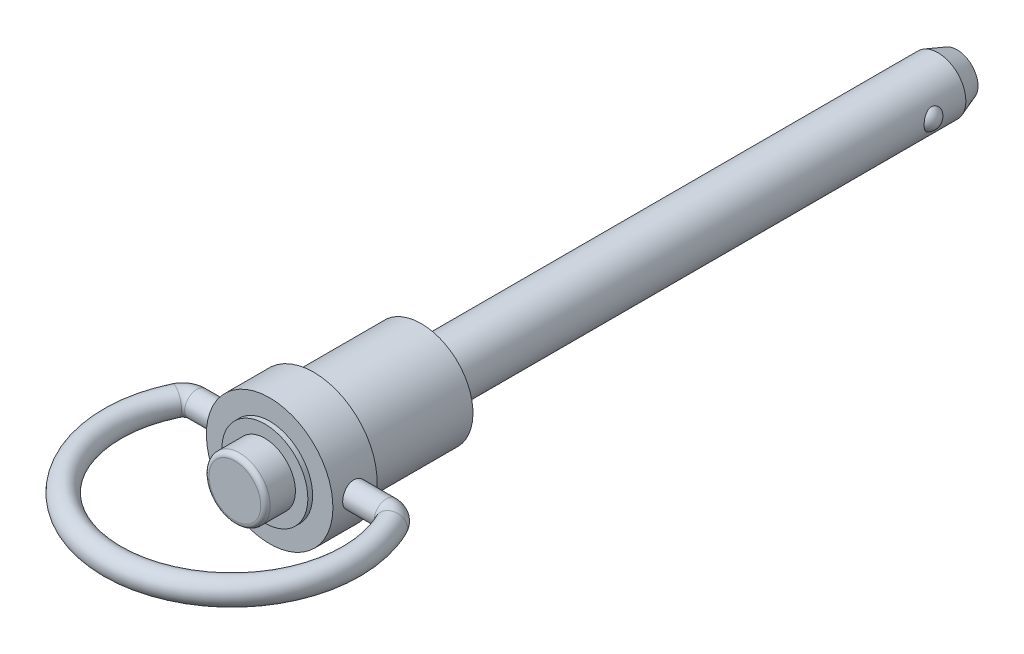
ISO-10303-21;
HEADER;
FILE_DESCRIPTION(('STEP AP214'),'2;1');
FILE_NAME('part.step','',(''),(''),'','','');
FILE_SCHEMA(('AUTOMOTIVE_DESIGN { 1 0 10303 214 1 1 1 1 }'));
ENDSEC;
DATA;
#1=APPLICATION_CONTEXT('core data for automotive mechanical design processes');
#2=APPLICATION_PROTOCOL_DEFINITION('international standard','automotive_design',2000,#1);
#3=PRODUCT_CONTEXT('',#1,'mechanical');
#4=PRODUCT('Part','Part','',(#3));
#5=PRODUCT_RELATED_PRODUCT_CATEGORY('part','',(#4));
#6=PRODUCT_DEFINITION_FORMATION('','',#4);
#7=PRODUCT_DEFINITION_CONTEXT('part definition',#1,'design');
#8=PRODUCT_DEFINITION('design','',#6,#7);
#9=PRODUCT_DEFINITION_SHAPE('','',#8);
#10=(LENGTH_UNIT() NAMED_UNIT(*) SI_UNIT(.MILLI.,.METRE.));
#11=(NAMED_UNIT(*) PLANE_ANGLE_UNIT() SI_UNIT($,.RADIAN.));
#12=(NAMED_UNIT(*) SI_UNIT($,.STERADIAN.) SOLID_ANGLE_UNIT());
#13=UNCERTAINTY_MEASURE_WITH_UNIT(LENGTH_MEASURE(1.E-05),#10,'distance_accuracy_value','');
#14=(GEOMETRIC_REPRESENTATION_CONTEXT(3) GLOBAL_UNCERTAINTY_ASSIGNED_CONTEXT((#13)) GLOBAL_UNIT_ASSIGNED_CONTEXT((#10,
#11,#12)) REPRESENTATION_CONTEXT('',''));
#15=CARTESIAN_POINT('',(0.,0.,0.));
#16=DIRECTION('',(0.,0.,1.));
#17=DIRECTION('',(1.,0.,0.));
#18=AXIS2_PLACEMENT_3D('',#15,#16,#17);
#19=CARTESIAN_POINT('',(0.,0.,20.828));
#20=DIRECTION('',(0.,0.,-1.));
#21=DIRECTION('',(0.,1.,0.));
#22=AXIS2_PLACEMENT_3D('',#19,#20,#21);
#23=CYLINDRICAL_SURFACE('',#22,3.2512);
#24=CARTESIAN_POINT('',(0.,0.,16.637));
#25=DIRECTION('',(0.,0.,-1.));
#26=DIRECTION('',(0.,1.,0.));
#27=AXIS2_PLACEMENT_3D('',#24,#25,#26);
#28=CIRCLE('',#27,3.2512);
#29=CARTESIAN_POINT('',(0.,3.2512,16.637));
#30=VERTEX_POINT('',#29);
#31=EDGE_CURVE('E35',#30,#30,#28,.T.);
#32=ORIENTED_EDGE('',*,*,#31,.F.);
#33=EDGE_LOOP('',(#32));
#34=FACE_BOUND('',#33,.T.);
#35=CARTESIAN_POINT('',(0.,0.,19.328));
#36=DIRECTION('',(0.,0.,1.));
#37=DIRECTION('',(1.,0.,0.));
#38=AXIS2_PLACEMENT_3D('',#35,#36,#37);
#39=CIRCLE('',#38,3.2512);
#40=CARTESIAN_POINT('',(3.2512,0.,19.328));
#41=VERTEX_POINT('',#40);
#42=EDGE_CURVE('E157',#41,#41,#39,.T.);
#43=ORIENTED_EDGE('',*,*,#42,.F.);
#44=EDGE_LOOP('',(#43));
#45=FACE_BOUND('',#44,.T.);
#46=ADVANCED_FACE('F13',(#34,#45),#23,.T.);
#47=CARTESIAN_POINT('',(4.572,0.,16.637));
#48=DIRECTION('',(0.,0.,1.));
#49=DIRECTION('',(0.,-1.,0.));
#50=AXIS2_PLACEMENT_3D('',#47,#48,#49);
#51=PLANE('',#50);
#52=ORIENTED_EDGE('',*,*,#31,.T.);
#53=EDGE_LOOP('',(#52));
#54=FACE_BOUND('',#53,.T.);
#55=CARTESIAN_POINT('',(0.,0.,16.637));
#56=DIRECTION('',(0.,0.,-1.));
#57=DIRECTION('',(0.,1.,0.));
#58=AXIS2_PLACEMENT_3D('',#55,#56,#57);
#59=CIRCLE('',#58,4.572);
#60=CARTESIAN_POINT('',(0.,4.572,16.637));
#61=VERTEX_POINT('',#60);
#62=EDGE_CURVE('E40',#61,#61,#59,.T.);
#63=ORIENTED_EDGE('',*,*,#62,.F.);
#64=EDGE_LOOP('',(#63));
#65=FACE_BOUND('',#64,.T.);
#66=ADVANCED_FACE('F81',(#54,#65),#51,.T.);
#67=CARTESIAN_POINT('',(0.,0.,0.));
#68=DIRECTION('',(0.,0.,-1.));
#69=DIRECTION('',(0.,1.,0.));
#70=AXIS2_PLACEMENT_3D('',#67,#68,#69);
#71=CYLINDRICAL_SURFACE('',#70,4.572);
#72=ORIENTED_EDGE('',*,*,#62,.T.);
#73=EDGE_LOOP('',(#72));
#74=FACE_BOUND('',#73,.T.);
#75=CARTESIAN_POINT('',(0.,0.,16.129));
#76=DIRECTION('',(0.,0.,-1.));
#77=DIRECTION('',(0.,1.,0.));
#78=AXIS2_PLACEMENT_3D('',#75,#76,#77);
#79=CIRCLE('',#78,4.572);
#80=CARTESIAN_POINT('',(0.,4.572,16.129));
#81=VERTEX_POINT('',#80);
#82=EDGE_CURVE('E43',#81,#81,#79,.T.);
#83=ORIENTED_EDGE('',*,*,#82,.F.);
#84=EDGE_LOOP('',(#83));
#85=FACE_BOUND('',#84,.T.);
#86=ADVANCED_FACE('F151',(#74,#85),#71,.T.);
#87=CARTESIAN_POINT('',(6.731,0.,16.129));
#88=DIRECTION('',(0.,0.,1.));
#89=DIRECTION('',(0.,-1.,0.));
#90=AXIS2_PLACEMENT_3D('',#87,#88,#89);
#91=PLANE('',#90);
#92=CARTESIAN_POINT('',(0.,0.,16.129));
#93=DIRECTION('',(0.,0.,-1.));
#94=DIRECTION('',(0.,1.,0.));
#95=AXIS2_PLACEMENT_3D('',#92,#93,#94);
#96=CIRCLE('',#95,6.731);
#97=CARTESIAN_POINT('',(0.,6.731,16.129));
#98=VERTEX_POINT('',#97);
#99=EDGE_CURVE('E46',#98,#98,#96,.T.);
#100=ORIENTED_EDGE('',*,*,#99,.F.);
#101=EDGE_LOOP('',(#100));
#102=FACE_BOUND('',#101,.T.);
#103=ORIENTED_EDGE('',*,*,#82,.T.);
#104=EDGE_LOOP('',(#103));
#105=FACE_BOUND('',#104,.T.);
#106=ADVANCED_FACE('F194',(#102,#105),#91,.T.);
#107=CARTESIAN_POINT('',(0.,0.,0.));
#108=DIRECTION('',(0.,0.,-1.));
#109=DIRECTION('',(0.,1.,0.));
#110=AXIS2_PLACEMENT_3D('',#107,#108,#109);
#111=CYLINDRICAL_SURFACE('',#110,6.731);
#112=ORIENTED_EDGE('',*,*,#99,.T.);
#113=EDGE_LOOP('',(#112));
#114=FACE_BOUND('',#113,.T.);
#115=CARTESIAN_POINT('',(0.,0.,11.43));
#116=DIRECTION('',(0.,0.,-1.));
#117=DIRECTION('',(0.,1.,0.));
#118=AXIS2_PLACEMENT_3D('',#115,#116,#117);
#119=CIRCLE('',#118,6.731);
#120=CARTESIAN_POINT('',(0.,6.731,11.43));
#121=VERTEX_POINT('',#120);
#122=EDGE_CURVE('E34',#121,#121,#119,.T.);
#123=ORIENTED_EDGE('',*,*,#122,.F.);
#124=EDGE_LOOP('',(#123));
#125=FACE_BOUND('',#124,.T.);
#126=CARTESIAN_POINT('',(-6.6051722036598,1.2954,13.7922));
#127=CARTESIAN_POINT('',(-6.60517361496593,1.2953972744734,13.864236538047));
#128=CARTESIAN_POINT('',(-6.60636346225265,1.28937073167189,13.9363080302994));
#129=CARTESIAN_POINT('',(-6.61098794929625,1.26544153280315,14.0784162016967));
#130=CARTESIAN_POINT('',(-6.61442445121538,1.2475290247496,14.1484511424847));
#131=CARTESIAN_POINT('',(-6.62313895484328,1.20040052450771,14.2844095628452));
#132=CARTESIAN_POINT('',(-6.62841519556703,1.17119533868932,14.3503369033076));
#133=CARTESIAN_POINT('',(-6.64021258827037,1.10233951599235,14.4763528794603));
#134=CARTESIAN_POINT('',(-6.64673365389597,1.06268960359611,14.5364419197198));
#135=CARTESIAN_POINT('',(-6.66038139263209,0.973516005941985,14.6498669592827));
#136=CARTESIAN_POINT('',(-6.66751428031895,0.923881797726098,14.7031153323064));
#137=CARTESIAN_POINT('',(-6.68152715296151,0.816387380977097,14.8005834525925));
#138=CARTESIAN_POINT('',(-6.6884071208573,0.758526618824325,14.8448025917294));
#139=CARTESIAN_POINT('',(-6.7012057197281,0.635644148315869,14.9232944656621));
#140=CARTESIAN_POINT('',(-6.70711617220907,0.570568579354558,14.9574843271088));
#141=CARTESIAN_POINT('',(-6.71724013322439,0.435464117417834,15.014412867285));
#142=CARTESIAN_POINT('',(-6.72145378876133,0.365435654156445,15.0371525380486));
#143=CARTESIAN_POINT('',(-6.72766549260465,0.223321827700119,15.0702635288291));
#144=CARTESIAN_POINT('',(-6.72968999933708,0.151272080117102,15.0807826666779));
#145=CARTESIAN_POINT('',(-6.73138656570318,0.00640388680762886,15.089614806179));
#146=CARTESIAN_POINT('',(-6.73105883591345,-0.0664144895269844,15.0879289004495));
#147=CARTESIAN_POINT('',(-6.72810846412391,-0.209738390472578,15.072511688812));
#148=CARTESIAN_POINT('',(-6.72551615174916,-0.280261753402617,15.0589395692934));
#149=CARTESIAN_POINT('',(-6.71836197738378,-0.418011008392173,15.0203872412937));
#150=CARTESIAN_POINT('',(-6.71380004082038,-0.485236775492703,14.9954066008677));
#151=CARTESIAN_POINT('',(-6.70316878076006,-0.614941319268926,14.9345963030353));
#152=CARTESIAN_POINT('',(-6.69709072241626,-0.677389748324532,14.8987035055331));
#153=CARTESIAN_POINT('',(-6.68409856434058,-0.795436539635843,14.8171343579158));
#154=CARTESIAN_POINT('',(-6.677184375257,-0.851034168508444,14.7714569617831));
#155=CARTESIAN_POINT('',(-6.66315320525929,-0.954744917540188,14.6707395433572));
#156=CARTESIAN_POINT('',(-6.65603475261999,-1.00272266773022,14.6155602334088));
#157=CARTESIAN_POINT('',(-6.64250376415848,-1.08876420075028,14.4978679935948));
#158=CARTESIAN_POINT('',(-6.63609123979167,-1.12682782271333,14.4353549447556));
#159=CARTESIAN_POINT('',(-6.62469571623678,-1.19200234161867,14.3045844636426));
#160=CARTESIAN_POINT('',(-6.61971540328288,-1.2190926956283,14.2363165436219));
#161=CARTESIAN_POINT('',(-6.61178862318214,-1.26138008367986,14.0960804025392));
#162=CARTESIAN_POINT('',(-6.60884191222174,-1.27657854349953,14.0241126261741));
#163=CARTESIAN_POINT('',(-6.60536444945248,-1.29445125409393,13.8797427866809));
#164=CARTESIAN_POINT('',(-6.60479610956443,-1.29732037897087,13.8073657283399));
#165=CARTESIAN_POINT('',(-6.60603903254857,-1.29097613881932,13.6631669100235));
#166=CARTESIAN_POINT('',(-6.60785017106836,-1.28176340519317,13.5913451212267));
#167=CARTESIAN_POINT('',(-6.6136128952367,-1.25168453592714,13.4509418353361));
#168=CARTESIAN_POINT('',(-6.61754556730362,-1.23092132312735,13.3823374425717));
#169=CARTESIAN_POINT('',(-6.62709183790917,-1.17844042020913,13.249581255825));
#170=CARTESIAN_POINT('',(-6.63270556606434,-1.14672188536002,13.1854298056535));
#171=CARTESIAN_POINT('',(-6.64506657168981,-1.0727850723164,13.0625442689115));
#172=CARTESIAN_POINT('',(-6.65182676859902,-1.0304441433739,13.0038853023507));
#173=CARTESIAN_POINT('',(-6.66568301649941,-0.936629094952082,12.8944341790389));
#174=CARTESIAN_POINT('',(-6.67277909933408,-0.885154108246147,12.8436427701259));
#175=CARTESIAN_POINT('',(-6.68662882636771,-0.773660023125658,12.7506362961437));
#176=CARTESIAN_POINT('',(-6.69337621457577,-0.713530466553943,12.7085525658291));
#177=CARTESIAN_POINT('',(-6.70566168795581,-0.586941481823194,12.6350847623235));
#178=CARTESIAN_POINT('',(-6.71119982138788,-0.520482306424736,12.6037002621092));
#179=CARTESIAN_POINT('',(-6.720415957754,-0.383476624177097,12.5527164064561));
#180=CARTESIAN_POINT('',(-6.72410395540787,-0.312954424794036,12.5330536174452));
#181=CARTESIAN_POINT('',(-6.72924701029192,-0.169530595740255,12.5058694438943));
#182=CARTESIAN_POINT('',(-6.7307023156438,-0.0966292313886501,12.4983467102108));
#183=CARTESIAN_POINT('',(-6.73121071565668,0.0482259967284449,12.4957052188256));
#184=CARTESIAN_POINT('',(-6.73030215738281,0.120176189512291,12.5003884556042));
#185=CARTESIAN_POINT('',(-6.72626496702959,0.262244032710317,12.5215909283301));
#186=CARTESIAN_POINT('',(-6.72313635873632,0.33236170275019,12.5381100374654));
#187=CARTESIAN_POINT('',(-6.71501101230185,0.468662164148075,12.5824301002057));
#188=CARTESIAN_POINT('',(-6.710017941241,0.534852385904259,12.6102089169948));
#189=CARTESIAN_POINT('',(-6.69870305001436,0.66166145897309,12.6762356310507));
#190=CARTESIAN_POINT('',(-6.69238113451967,0.722279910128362,12.7144842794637));
#191=CARTESIAN_POINT('',(-6.6789853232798,0.837208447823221,12.8010411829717));
#192=CARTESIAN_POINT('',(-6.67190155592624,0.891410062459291,12.8494919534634));
#193=CARTESIAN_POINT('',(-6.65784127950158,0.990982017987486,12.95478313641));
#194=CARTESIAN_POINT('',(-6.65086479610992,1.03635027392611,13.0116255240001));
#195=CARTESIAN_POINT('',(-6.63773378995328,1.11738877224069,13.1327559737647));
#196=CARTESIAN_POINT('',(-6.63158802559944,1.15295925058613,13.1971117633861));
#197=CARTESIAN_POINT('',(-6.62092027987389,1.21272619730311,13.3309847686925));
#198=CARTESIAN_POINT('',(-6.61639678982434,1.23693323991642,13.4004971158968));
#199=CARTESIAN_POINT('',(-6.61041337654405,1.26845390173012,13.5238636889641));
#200=CARTESIAN_POINT('',(-6.60845980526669,1.27854107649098,13.57700269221));
#201=CARTESIAN_POINT('',(-6.60583870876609,1.29201504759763,13.6841545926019));
#202=CARTESIAN_POINT('',(-6.60517114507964,1.29540204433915,13.7381674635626));
#203=CARTESIAN_POINT('',(-6.6051722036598,1.2954,13.7922));
#204=B_SPLINE_CURVE_WITH_KNOTS('',3,(#126,#127,#128,#129,#130,#131,#132,#133,#134,#135,#136,
#137,#138,#139,#140,#141,#142,#143,#144,#145,#146,#147,#148,#149,#150,#151,#152,#153,#154,#155,
#156,#157,#158,#159,#160,#161,#162,#163,#164,#165,#166,#167,#168,#169,#170,#171,#172,#173,#174,
#175,#176,#177,#178,#179,#180,#181,#182,#183,#184,#185,#186,#187,#188,#189,#190,#191,#192,#193,
#194,#195,#196,#197,#198,#199,#200,#201,#202,#203),.UNSPECIFIED.,.T.,.F.,(4,2,2,2,2,2,2,2,2,2,2,
2,2,2,2,2,2,2,2,2,2,2,2,2,2,2,2,2,2,2,2,2,2,2,2,2,2,2,4),(0.,0.215911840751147,
0.432002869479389,0.647887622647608,0.86375740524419,1.08216318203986,1.30058366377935,
1.52076118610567,1.74091962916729,1.95838638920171,2.1758336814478,2.39041258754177,
2.60499961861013,2.82085272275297,3.0367289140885,3.25609136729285,3.47545737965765,
3.69523218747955,3.91498064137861,4.13124273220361,4.34749352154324,4.56184753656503,
4.7762180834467,4.9931879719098,5.2101784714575,5.430235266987,5.65028327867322,
5.86912939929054,6.08795119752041,6.30324544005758,6.5185373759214,6.73340808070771,
6.94829420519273,7.16640910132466,7.38457541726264,7.60488731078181,7.82499378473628,
7.9869478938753,8.14889715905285),.UNSPECIFIED.);
#205=CARTESIAN_POINT('',(-6.6051722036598,1.2954,13.7922));
#206=VERTEX_POINT('',#205);
#207=EDGE_CURVE('E28',#206,#206,#204,.T.);
#208=ORIENTED_EDGE('',*,*,#207,.T.);
#209=EDGE_LOOP('',(#208));
#210=FACE_BOUND('',#209,.T.);
#211=CARTESIAN_POINT('',(6.6051722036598,1.2954,13.7922));
#212=CARTESIAN_POINT('',(6.60517361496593,1.2953972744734,13.720163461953));
#213=CARTESIAN_POINT('',(6.60636346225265,1.28937073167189,13.6480919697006));
#214=CARTESIAN_POINT('',(6.61098794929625,1.26544153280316,13.5059837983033));
#215=CARTESIAN_POINT('',(6.61442445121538,1.2475290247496,13.4359488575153));
#216=CARTESIAN_POINT('',(6.62313895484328,1.20040052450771,13.2999904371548));
#217=CARTESIAN_POINT('',(6.62841519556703,1.17119533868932,13.2340630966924));
#218=CARTESIAN_POINT('',(6.64021258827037,1.10233951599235,13.1080471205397));
#219=CARTESIAN_POINT('',(6.64673365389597,1.06268960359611,13.0479580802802));
#220=CARTESIAN_POINT('',(6.66038139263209,0.973516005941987,12.9345330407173));
#221=CARTESIAN_POINT('',(6.66751428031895,0.9238817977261,12.8812846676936));
#222=CARTESIAN_POINT('',(6.68152715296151,0.816387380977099,12.7838165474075));
#223=CARTESIAN_POINT('',(6.6884071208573,0.758526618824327,12.7395974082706));
#224=CARTESIAN_POINT('',(6.7012057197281,0.635644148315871,12.6611055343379));
#225=CARTESIAN_POINT('',(6.70711617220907,0.570568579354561,12.6269156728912));
#226=CARTESIAN_POINT('',(6.71724013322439,0.435464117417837,12.569987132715));
#227=CARTESIAN_POINT('',(6.72145378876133,0.365435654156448,12.5472474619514));
#228=CARTESIAN_POINT('',(6.72766549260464,0.223321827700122,12.5141364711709));
#229=CARTESIAN_POINT('',(6.72968999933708,0.151272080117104,12.5036173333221));
#230=CARTESIAN_POINT('',(6.73138656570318,0.00640388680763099,12.494785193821));
#231=CARTESIAN_POINT('',(6.73105883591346,-0.0664144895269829,12.4964710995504));
#232=CARTESIAN_POINT('',(6.72810846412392,-0.209738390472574,12.511888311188));
#233=CARTESIAN_POINT('',(6.72551615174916,-0.28026175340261,12.5254604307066));
#234=CARTESIAN_POINT('',(6.71836197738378,-0.418011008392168,12.5640127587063));
#235=CARTESIAN_POINT('',(6.71380004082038,-0.485236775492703,12.5889933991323));
#236=CARTESIAN_POINT('',(6.70316878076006,-0.614941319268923,12.6498036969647));
#237=CARTESIAN_POINT('',(6.69709072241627,-0.677389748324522,12.6856964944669));
#238=CARTESIAN_POINT('',(6.68409856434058,-0.795436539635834,12.7672656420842));
#239=CARTESIAN_POINT('',(6.677184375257,-0.851034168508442,12.8129430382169));
#240=CARTESIAN_POINT('',(6.66315320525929,-0.954744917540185,12.9136604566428));
#241=CARTESIAN_POINT('',(6.65603475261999,-1.00272266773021,12.9688397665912));
#242=CARTESIAN_POINT('',(6.64250376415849,-1.08876420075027,13.0865320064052));
#243=CARTESIAN_POINT('',(6.63609123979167,-1.12682782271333,13.1490450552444));
#244=CARTESIAN_POINT('',(6.62469571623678,-1.19200234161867,13.2798155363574));
#245=CARTESIAN_POINT('',(6.61971540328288,-1.21909269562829,13.3480834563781));
#246=CARTESIAN_POINT('',(6.61178862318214,-1.26138008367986,13.4883195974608));
#247=CARTESIAN_POINT('',(6.60884191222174,-1.27657854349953,13.5602873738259));
#248=CARTESIAN_POINT('',(6.60536444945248,-1.29445125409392,13.7046572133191));
#249=CARTESIAN_POINT('',(6.60479610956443,-1.29732037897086,13.7770342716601));
#250=CARTESIAN_POINT('',(6.60603903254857,-1.29097613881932,13.9212330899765));
#251=CARTESIAN_POINT('',(6.60785017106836,-1.28176340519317,13.9930548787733));
#252=CARTESIAN_POINT('',(6.6136128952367,-1.25168453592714,14.1334581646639));
#253=CARTESIAN_POINT('',(6.61754556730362,-1.23092132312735,14.2020625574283));
#254=CARTESIAN_POINT('',(6.62709183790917,-1.17844042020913,14.334818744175));
#255=CARTESIAN_POINT('',(6.63270556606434,-1.14672188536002,14.3989701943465));
#256=CARTESIAN_POINT('',(6.64506657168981,-1.07278507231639,14.5218557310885));
#257=CARTESIAN_POINT('',(6.65182676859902,-1.03044414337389,14.5805146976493));
#258=CARTESIAN_POINT('',(6.66568301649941,-0.936629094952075,14.6899658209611));
#259=CARTESIAN_POINT('',(6.67277909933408,-0.885154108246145,14.7407572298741));
#260=CARTESIAN_POINT('',(6.68662882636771,-0.773660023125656,14.8337637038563));
#261=CARTESIAN_POINT('',(6.69337621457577,-0.713530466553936,14.8758474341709));
#262=CARTESIAN_POINT('',(6.70566168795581,-0.586941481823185,14.9493152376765));
#263=CARTESIAN_POINT('',(6.71119982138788,-0.520482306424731,14.9806997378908));
#264=CARTESIAN_POINT('',(6.720415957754,-0.383476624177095,15.0316835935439));
#265=CARTESIAN_POINT('',(6.72410395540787,-0.312954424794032,15.0513463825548));
#266=CARTESIAN_POINT('',(6.72924701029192,-0.169530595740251,15.0785305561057));
#267=CARTESIAN_POINT('',(6.7307023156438,-0.096629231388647,15.0860532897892));
#268=CARTESIAN_POINT('',(6.73121071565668,0.0482259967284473,15.0886947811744));
#269=CARTESIAN_POINT('',(6.73030215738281,0.120176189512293,15.0840115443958));
#270=CARTESIAN_POINT('',(6.72626496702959,0.262244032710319,15.0628090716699));
#271=CARTESIAN_POINT('',(6.72313635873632,0.332361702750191,15.0462899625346));
#272=CARTESIAN_POINT('',(6.71501101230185,0.468662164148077,15.0019698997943));
#273=CARTESIAN_POINT('',(6.710017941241,0.534852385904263,14.9741910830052));
#274=CARTESIAN_POINT('',(6.69870305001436,0.661661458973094,14.9081643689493));
#275=CARTESIAN_POINT('',(6.69238113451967,0.722279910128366,14.8699157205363));
#276=CARTESIAN_POINT('',(6.6789853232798,0.837208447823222,14.7833588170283));
#277=CARTESIAN_POINT('',(6.67190155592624,0.891410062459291,14.7349080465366));
#278=CARTESIAN_POINT('',(6.65784127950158,0.990982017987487,14.62961686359));
#279=CARTESIAN_POINT('',(6.65086479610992,1.03635027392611,14.5727744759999));
#280=CARTESIAN_POINT('',(6.63773378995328,1.11738877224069,14.4516440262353));
#281=CARTESIAN_POINT('',(6.63158802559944,1.15295925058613,14.3872882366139));
#282=CARTESIAN_POINT('',(6.62092027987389,1.21272619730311,14.2534152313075));
#283=CARTESIAN_POINT('',(6.61639678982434,1.23693323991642,14.1839028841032));
#284=CARTESIAN_POINT('',(6.61041337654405,1.26845390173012,14.0605363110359));
#285=CARTESIAN_POINT('',(6.60845980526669,1.27854107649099,14.00739730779));
#286=CARTESIAN_POINT('',(6.60583870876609,1.29201504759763,13.9002454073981));
#287=CARTESIAN_POINT('',(6.60517114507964,1.29540204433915,13.8462325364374));
#288=CARTESIAN_POINT('',(6.6051722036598,1.2954,13.7922));
#289=B_SPLINE_CURVE_WITH_KNOTS('',3,(#211,#212,#213,#214,#215,#216,#217,#218,#219,#220,#221,
#222,#223,#224,#225,#226,#227,#228,#229,#230,#231,#232,#233,#234,#235,#236,#237,#238,#239,#240,
#241,#242,#243,#244,#245,#246,#247,#248,#249,#250,#251,#252,#253,#254,#255,#256,#257,#258,#259,
#260,#261,#262,#263,#264,#265,#266,#267,#268,#269,#270,#271,#272,#273,#274,#275,#276,#277,#278,
#279,#280,#281,#282,#283,#284,#285,#286,#287,#288),.UNSPECIFIED.,.T.,.F.,(4,2,2,2,2,2,2,2,2,2,2,
2,2,2,2,2,2,2,2,2,2,2,2,2,2,2,2,2,2,2,2,2,2,2,2,2,2,2,4),(0.,0.215911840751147,
0.432002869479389,0.647887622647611,0.86375740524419,1.08216318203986,1.30058366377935,
1.52076118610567,1.74091962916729,1.95838638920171,2.1758336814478,2.39041258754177,
2.60499961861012,2.82085272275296,3.0367289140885,3.25609136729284,3.47545737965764,
3.69523218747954,3.91498064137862,4.13124273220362,4.34749352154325,4.56184753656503,
4.77621808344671,4.99318797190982,5.21017847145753,5.43023526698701,5.65028327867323,
5.86912939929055,6.08795119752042,6.30324544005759,6.51853737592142,6.73340808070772,
6.94829420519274,7.16640910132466,7.38457541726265,7.60488731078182,7.82499378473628,
7.98694789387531,8.14889715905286),.UNSPECIFIED.);
#290=CARTESIAN_POINT('',(6.6051722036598,1.2954,13.7922));
#291=VERTEX_POINT('',#290);
#292=EDGE_CURVE('E24',#291,#291,#289,.T.);
#293=ORIENTED_EDGE('',*,*,#292,.T.);
#294=EDGE_LOOP('',(#293));
#295=FACE_BOUND('',#294,.T.);
#296=ADVANCED_FACE('F143',(#114,#125,#210,#295),#111,.T.);
#297=CARTESIAN_POINT('',(5.7785,0.,11.43));
#298=DIRECTION('',(0.,0.,-1.));
#299=DIRECTION('',(0.,1.,0.));
#300=AXIS2_PLACEMENT_3D('',#297,#298,#299);
#301=PLANE('',#300);
#302=CARTESIAN_POINT('',(0.,0.,11.43));
#303=DIRECTION('',(0.,0.,-1.));
#304=DIRECTION('',(0.,1.,0.));
#305=AXIS2_PLACEMENT_3D('',#302,#303,#304);
#306=CIRCLE('',#305,5.9);
#307=CARTESIAN_POINT('',(0.,5.9,11.43));
#308=VERTEX_POINT('',#307);
#309=EDGE_CURVE('E20',#308,#308,#306,.F.);
#310=ORIENTED_EDGE('',*,*,#309,.T.);
#311=EDGE_LOOP('',(#310));
#312=FACE_BOUND('',#311,.T.);
#313=ORIENTED_EDGE('',*,*,#122,.T.);
#314=EDGE_LOOP('',(#313));
#315=FACE_BOUND('',#314,.T.);
#316=ADVANCED_FACE('F137',(#312,#315),#301,.T.);
#317=CARTESIAN_POINT('',(10.0803124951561,0.,15.3162));
#318=DIRECTION('',(0.,1.,0.));
#319=DIRECTION('',(-1.,0.,0.));
#320=AXIS2_PLACEMENT_3D('',#317,#318,#319);
#321=TOROIDAL_SURFACE('',#320,1.524,1.2954);
#322=CARTESIAN_POINT('',(11.4549005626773,0.,14.658109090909));
#323=DIRECTION('',(-0.431818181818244,0.,-0.901960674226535));
#324=DIRECTION('',(0.901960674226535,0.,-0.431818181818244));
#325=AXIS2_PLACEMENT_3D('',#322,#323,#324);
#326=CIRCLE('',#325,1.2954);
#327=CARTESIAN_POINT('',(12.6233004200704,0.,14.0987318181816));
#328=VERTEX_POINT('',#327);
#329=EDGE_CURVE('E51',#328,#328,#326,.T.);
#330=ORIENTED_EDGE('',*,*,#329,.T.);
#331=EDGE_LOOP('',(#330));
#332=FACE_BOUND('',#331,.T.);
#333=CARTESIAN_POINT('',(10.0803124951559,0.,13.7922));
#334=DIRECTION('',(1.,0.,0.));
#335=DIRECTION('',(0.,1.,0.));
#336=AXIS2_PLACEMENT_3D('',#333,#334,#335);
#337=CIRCLE('',#336,1.2954);
#338=CARTESIAN_POINT('',(10.0803124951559,1.2954,13.7922));
#339=VERTEX_POINT('',#338);
#340=EDGE_CURVE('E39',#339,#339,#337,.F.);
#341=ORIENTED_EDGE('',*,*,#340,.F.);
#342=EDGE_LOOP('',(#341));
#343=FACE_BOUND('',#342,.T.);
#344=ADVANCED_FACE('F79',(#332,#343),#321,.T.);
#345=CARTESIAN_POINT('',(-10.0803124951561,0.,13.7922));
#346=DIRECTION('',(1.,0.,0.));
#347=DIRECTION('',(0.,1.,0.));
#348=AXIS2_PLACEMENT_3D('',#345,#346,#347);
#349=CYLINDRICAL_SURFACE('',#348,1.2954);
#350=ORIENTED_EDGE('',*,*,#292,.F.);
#351=EDGE_LOOP('',(#350));
#352=FACE_BOUND('',#351,.T.);
#353=ORIENTED_EDGE('',*,*,#340,.T.);
#354=EDGE_LOOP('',(#353));
#355=FACE_BOUND('',#354,.T.);
#356=ADVANCED_FACE('F75',(#352,#355),#349,.T.);
#357=CARTESIAN_POINT('',(0.,0.,20.1422));
#358=DIRECTION('',(0.,1.,0.));
#359=DIRECTION('',(-1.,0.,0.));
#360=AXIS2_PLACEMENT_3D('',#357,#358,#359);
#361=TOROIDAL_SURFACE('',#360,12.7,1.2954);
#362=CARTESIAN_POINT('',(-11.4549005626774,0.,14.6581090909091));
#363=DIRECTION('',(-0.43181818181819,0.,0.901960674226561));
#364=DIRECTION('',(-0.901960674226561,0.,-0.43181818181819));
#365=AXIS2_PLACEMENT_3D('',#362,#363,#364);
#366=CIRCLE('',#365,1.2954);
#367=CARTESIAN_POINT('',(-12.6233004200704,0.,14.0987318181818));
#368=VERTEX_POINT('',#367);
#369=EDGE_CURVE('E54',#368,#368,#366,.F.);
#370=ORIENTED_EDGE('',*,*,#369,.F.);
#371=EDGE_LOOP('',(#370));
#372=FACE_BOUND('',#371,.T.);
#373=ORIENTED_EDGE('',*,*,#329,.F.);
#374=EDGE_LOOP('',(#373));
#375=FACE_BOUND('',#374,.T.);
#376=ADVANCED_FACE('F72',(#372,#375),#361,.T.);
#377=CARTESIAN_POINT('',(-10.0803124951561,0.,15.3162));
#378=DIRECTION('',(0.,1.,0.));
#379=DIRECTION('',(-1.,0.,0.));
#380=AXIS2_PLACEMENT_3D('',#377,#378,#379);
#381=TOROIDAL_SURFACE('',#380,1.524,1.2954);
#382=CARTESIAN_POINT('',(-10.0803124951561,0.,13.7922));
#383=DIRECTION('',(1.,0.,0.));
#384=DIRECTION('',(0.,1.,0.));
#385=AXIS2_PLACEMENT_3D('',#382,#383,#384);
#386=CIRCLE('',#385,1.2954);
#387=CARTESIAN_POINT('',(-10.0803124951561,1.2954,13.7922));
#388=VERTEX_POINT('',#387);
#389=EDGE_CURVE('E38',#388,#388,#386,.T.);
#390=ORIENTED_EDGE('',*,*,#389,.F.);
#391=EDGE_LOOP('',(#390));
#392=FACE_BOUND('',#391,.T.);
#393=ORIENTED_EDGE('',*,*,#369,.T.);
#394=EDGE_LOOP('',(#393));
#395=FACE_BOUND('',#394,.T.);
#396=ADVANCED_FACE('F67',(#392,#395),#381,.T.);
#397=CARTESIAN_POINT('',(-10.0803124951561,0.,13.7922));
#398=DIRECTION('',(1.,0.,0.));
#399=DIRECTION('',(0.,1.,0.));
#400=AXIS2_PLACEMENT_3D('',#397,#398,#399);
#401=CYLINDRICAL_SURFACE('',#400,1.2954);
#402=ORIENTED_EDGE('',*,*,#207,.F.);
#403=EDGE_LOOP('',(#402));
#404=FACE_BOUND('',#403,.T.);
#405=ORIENTED_EDGE('',*,*,#389,.T.);
#406=EDGE_LOOP('',(#405));
#407=FACE_BOUND('',#406,.T.);
#408=ADVANCED_FACE('F71',(#404,#407),#401,.T.);
#409=CARTESIAN_POINT('',(0.,0.,19.328));
#410=DIRECTION('',(0.,0.,1.));
#411=DIRECTION('',(1.,0.,0.));
#412=AXIS2_PLACEMENT_3D('',#409,#410,#411);
#413=TOROIDAL_SURFACE('',#412,2.7512,0.5);
#414=CARTESIAN_POINT('',(0.,0.,19.828));
#415=DIRECTION('',(0.,0.,1.));
#416=DIRECTION('',(1.,0.,0.));
#417=AXIS2_PLACEMENT_3D('',#414,#415,#416);
#418=CIRCLE('',#417,2.7512);
#419=CARTESIAN_POINT('',(2.7512,0.,19.828));
#420=VERTEX_POINT('',#419);
#421=EDGE_CURVE('E159',#420,#420,#418,.T.);
#422=ORIENTED_EDGE('',*,*,#421,.F.);
#423=EDGE_LOOP('',(#422));
#424=FACE_BOUND('',#423,.T.);
#425=ORIENTED_EDGE('',*,*,#42,.T.);
#426=EDGE_LOOP('',(#425));
#427=FACE_BOUND('',#426,.T.);
#428=ADVANCED_FACE('F98',(#424,#427),#413,.T.);
#429=CARTESIAN_POINT('',(0.,0.,19.828));
#430=DIRECTION('',(0.,0.,-1.));
#431=DIRECTION('',(-1.,0.,0.));
#432=AXIS2_PLACEMENT_3D('',#429,#430,#431);
#433=PLANE('',#432);
#434=ORIENTED_EDGE('',*,*,#421,.T.);
#435=EDGE_LOOP('',(#434));
#436=FACE_BOUND('',#435,.T.);
#437=ADVANCED_FACE('F171',(#436),#433,.F.);
#438=CARTESIAN_POINT('',(0.,0.,39.2538926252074));
#439=DIRECTION('',(0.,0.,-1.));
#440=DIRECTION('',(0.,1.,0.));
#441=AXIS2_PLACEMENT_3D('',#438,#439,#440);
#442=CYLINDRICAL_SURFACE('',#441,5.5);
#443=CARTESIAN_POINT('',(0.,0.,11.03));
#444=DIRECTION('',(0.,0.,-1.));
#445=DIRECTION('',(0.,1.,0.));
#446=AXIS2_PLACEMENT_3D('',#443,#444,#445);
#447=CIRCLE('',#446,5.5);
#448=CARTESIAN_POINT('',(0.,5.5,11.03));
#449=VERTEX_POINT('',#448);
#450=EDGE_CURVE('E8',#449,#449,#447,.T.);
#451=ORIENTED_EDGE('',*,*,#450,.T.);
#452=EDGE_LOOP('',(#451));
#453=FACE_BOUND('',#452,.T.);
#454=CARTESIAN_POINT('',(0.,0.,0.));
#455=DIRECTION('',(0.,0.,-1.));
#456=DIRECTION('',(0.,1.,0.));
#457=AXIS2_PLACEMENT_3D('',#454,#455,#456);
#458=CIRCLE('',#457,5.5);
#459=CARTESIAN_POINT('',(0.,5.5,0.));
#460=VERTEX_POINT('',#459);
#461=EDGE_CURVE('E162',#460,#460,#458,.T.);
#462=ORIENTED_EDGE('',*,*,#461,.F.);
#463=EDGE_LOOP('',(#462));
#464=FACE_BOUND('',#463,.T.);
#465=ADVANCED_FACE('F105',(#453,#464),#442,.T.);
#466=CARTESIAN_POINT('',(2.23030748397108,0.,-56.9964));
#467=DIRECTION('',(0.,0.,1.));
#468=DIRECTION('',(0.,-1.,0.));
#469=AXIS2_PLACEMENT_3D('',#466,#467,#468);
#470=PLANE('',#469);
#471=CARTESIAN_POINT('',(0.,0.,-56.9963999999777));
#472=DIRECTION('',(0.,0.,1.));
#473=DIRECTION('',(0.,-1.,0.));
#474=AXIS2_PLACEMENT_3D('',#471,#472,#473);
#475=CIRCLE('',#474,2.23030748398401);
#476=CARTESIAN_POINT('',(0.,-2.23030748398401,-56.9963999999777));
#477=VERTEX_POINT('',#476);
#478=EDGE_CURVE('E124',#477,#477,#475,.T.);
#479=ORIENTED_EDGE('',*,*,#478,.F.);
#480=EDGE_LOOP('',(#479));
#481=FACE_BOUND('',#480,.T.);
#482=ADVANCED_FACE('F100',(#481),#470,.F.);
#483=CARTESIAN_POINT('',(2.304415,0.,-51.51));
#484=DIRECTION('',(0.,0.,1.));
#485=DIRECTION('',(1.,0.,0.));
#486=AXIS2_PLACEMENT_3D('',#483,#484,#485);
#487=SPHERICAL_SURFACE('',#486,1.190625);
#488=CARTESIAN_POINT('',(2.969895,0.,-50.5227187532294));
#489=CARTESIAN_POINT('',(2.96989215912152,0.0648797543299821,-50.5227204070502));
#490=CARTESIAN_POINT('',(2.9677488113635,0.12981361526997,-50.5276893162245));
#491=CARTESIAN_POINT('',(2.95937088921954,0.257945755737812,-50.547546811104));
#492=CARTESIAN_POINT('',(2.95313050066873,0.321141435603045,-50.5624494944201));
#493=CARTESIAN_POINT('',(2.93717671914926,0.443963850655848,-50.6020770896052));
#494=CARTESIAN_POINT('',(2.92746163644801,0.50358883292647,-50.6268067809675));
#495=CARTESIAN_POINT('',(2.90558938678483,0.617402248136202,-50.6858521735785));
#496=CARTESIAN_POINT('',(2.89343280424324,0.67159197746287,-50.7201655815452));
#497=CARTESIAN_POINT('',(2.86839420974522,0.771479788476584,-50.7970051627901));
#498=CARTESIAN_POINT('',(2.85553685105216,0.8173515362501,-50.839312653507));
#499=CARTESIAN_POINT('',(2.83044802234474,0.900403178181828,-50.9319248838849));
#500=CARTESIAN_POINT('',(2.81821622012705,0.937587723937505,-50.9822253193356));
#501=CARTESIAN_POINT('',(2.79710280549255,0.99872451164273,-51.084854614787));
#502=CARTESIAN_POINT('',(2.78802161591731,1.02355036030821,-51.1366201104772));
#503=CARTESIAN_POINT('',(2.77310306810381,1.06331271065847,-51.2442484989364));
#504=CARTESIAN_POINT('',(2.76726231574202,1.07825956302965,-51.3001070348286));
#505=CARTESIAN_POINT('',(2.76014564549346,1.09633656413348,-51.4072555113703));
#506=CARTESIAN_POINT('',(2.75841717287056,1.10064055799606,-51.4583195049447));
#507=CARTESIAN_POINT('',(2.75839177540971,1.10070545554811,-51.5604466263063));
#508=CARTESIAN_POINT('',(2.76009369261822,1.09646924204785,-51.6115097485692));
#509=CARTESIAN_POINT('',(2.76652257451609,1.08013788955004,-51.7091717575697));
#510=CARTESIAN_POINT('',(2.7710736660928,1.06849907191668,-51.7558600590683));
#511=CARTESIAN_POINT('',(2.7825417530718,1.03826646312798,-51.8466097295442));
#512=CARTESIAN_POINT('',(2.78945904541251,1.01967179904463,-51.8906707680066));
#513=CARTESIAN_POINT('',(2.80531085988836,0.975235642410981,-51.9770453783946));
#514=CARTESIAN_POINT('',(2.81431949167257,0.949116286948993,-52.019201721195));
#515=CARTESIAN_POINT('',(2.83329926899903,0.890858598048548,-52.0988701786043));
#516=CARTESIAN_POINT('',(2.84327072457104,0.858718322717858,-52.1363807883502));
#517=CARTESIAN_POINT('',(2.86435381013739,0.785708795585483,-52.2098499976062));
#518=CARTESIAN_POINT('',(2.8754770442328,0.744281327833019,-52.2452503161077));
#519=CARTESIAN_POINT('',(2.89682125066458,0.656317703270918,-52.3093556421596));
#520=CARTESIAN_POINT('',(2.90704166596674,0.609778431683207,-52.3380565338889));
#521=CARTESIAN_POINT('',(2.92666236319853,0.507820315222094,-52.391048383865));
#522=CARTESIAN_POINT('',(2.93587462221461,0.451979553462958,-52.4145978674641));
#523=CARTESIAN_POINT('',(2.95127580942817,0.337048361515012,-52.4530177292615));
#524=CARTESIAN_POINT('',(2.95746769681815,0.277961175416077,-52.4678966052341));
#525=CARTESIAN_POINT('',(2.96452684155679,0.182100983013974,-52.4846891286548));
#526=CARTESIAN_POINT('',(2.96653354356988,0.145876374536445,-52.4894090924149));
#527=CARTESIAN_POINT('',(2.96921843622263,0.0731069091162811,-52.4957056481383));
#528=CARTESIAN_POINT('',(2.9698966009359,0.0365620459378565,-52.4972821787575));
#529=CARTESIAN_POINT('',(2.96989215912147,-0.0648797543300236,-52.4972795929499));
#530=CARTESIAN_POINT('',(2.96774881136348,-0.129813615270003,-52.4923106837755));
#531=CARTESIAN_POINT('',(2.95937088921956,-0.257945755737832,-52.472453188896));
#532=CARTESIAN_POINT('',(2.95313050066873,-0.32114143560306,-52.4575505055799));
#533=CARTESIAN_POINT('',(2.93717671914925,-0.443963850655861,-52.4179229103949));
#534=CARTESIAN_POINT('',(2.927461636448,-0.503588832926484,-52.3931932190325));
#535=CARTESIAN_POINT('',(2.90558938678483,-0.617402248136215,-52.3341478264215));
#536=CARTESIAN_POINT('',(2.89343280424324,-0.67159197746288,-52.2998344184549));
#537=CARTESIAN_POINT('',(2.86839420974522,-0.771479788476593,-52.2229948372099));
#538=CARTESIAN_POINT('',(2.85553685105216,-0.81735153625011,-52.180687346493));
#539=CARTESIAN_POINT('',(2.83044802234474,-0.900403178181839,-52.0880751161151));
#540=CARTESIAN_POINT('',(2.81821622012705,-0.937587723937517,-52.0377746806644));
#541=CARTESIAN_POINT('',(2.79710280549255,-0.998724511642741,-51.935145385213));
#542=CARTESIAN_POINT('',(2.78802161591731,-1.02355036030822,-51.8833798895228));
#543=CARTESIAN_POINT('',(2.77310306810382,-1.06331271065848,-51.7757515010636));
#544=CARTESIAN_POINT('',(2.76726231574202,-1.07825956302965,-51.7198929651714));
#545=CARTESIAN_POINT('',(2.76014564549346,-1.09633656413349,-51.6127444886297));
#546=CARTESIAN_POINT('',(2.75841717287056,-1.10064055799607,-51.5616804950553));
#547=CARTESIAN_POINT('',(2.75839177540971,-1.10070545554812,-51.4595533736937));
#548=CARTESIAN_POINT('',(2.76009369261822,-1.09646924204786,-51.4084902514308));
#549=CARTESIAN_POINT('',(2.76652257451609,-1.08013788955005,-51.3108282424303));
#550=CARTESIAN_POINT('',(2.7710736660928,-1.06849907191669,-51.2641399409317));
#551=CARTESIAN_POINT('',(2.78254175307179,-1.03826646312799,-51.1733902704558));
#552=CARTESIAN_POINT('',(2.78945904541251,-1.01967179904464,-51.1293292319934));
#553=CARTESIAN_POINT('',(2.80531085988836,-0.975235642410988,-51.0429546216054));
#554=CARTESIAN_POINT('',(2.81431949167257,-0.949116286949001,-51.000798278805));
#555=CARTESIAN_POINT('',(2.83329926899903,-0.890858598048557,-50.9211298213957));
#556=CARTESIAN_POINT('',(2.84327072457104,-0.858718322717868,-50.8836192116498));
#557=CARTESIAN_POINT('',(2.86435381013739,-0.785708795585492,-50.8101500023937));
#558=CARTESIAN_POINT('',(2.8754770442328,-0.744281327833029,-50.7747496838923));
#559=CARTESIAN_POINT('',(2.89682125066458,-0.656317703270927,-50.7106443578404));
#560=CARTESIAN_POINT('',(2.90704166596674,-0.609778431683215,-50.6819434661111));
#561=CARTESIAN_POINT('',(2.92666236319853,-0.50782031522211,-50.6289516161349));
#562=CARTESIAN_POINT('',(2.93587462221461,-0.451979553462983,-50.6054021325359));
#563=CARTESIAN_POINT('',(2.95127580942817,-0.337048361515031,-50.5669822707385));
#564=CARTESIAN_POINT('',(2.95746769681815,-0.27796117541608,-50.552103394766));
#565=CARTESIAN_POINT('',(2.96452684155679,-0.18210098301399,-50.5353108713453));
#566=CARTESIAN_POINT('',(2.96653354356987,-0.145876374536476,-50.5305909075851));
#567=CARTESIAN_POINT('',(2.96921843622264,-0.0731069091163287,-50.5242943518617));
#568=CARTESIAN_POINT('',(2.96989660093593,-0.0365620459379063,-50.5227178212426));
#569=CARTESIAN_POINT('',(2.969895,0.,-50.5227187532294));
#570=B_SPLINE_CURVE_WITH_KNOTS('',3,(#488,#489,#490,#491,#492,#493,#494,#495,#496,#497,#498,
#499,#500,#501,#502,#503,#504,#505,#506,#507,#508,#509,#510,#511,#512,#513,#514,#515,#516,#517,
#518,#519,#520,#521,#522,#523,#524,#525,#526,#527,#528,#529,#530,#531,#532,#533,#534,#535,#536,
#537,#538,#539,#540,#541,#542,#543,#544,#545,#546,#547,#548,#549,#550,#551,#552,#553,#554,#555,
#556,#557,#558,#559,#560,#561,#562,#563,#564,#565,#566,#567,#568,#569),.UNSPECIFIED.,.T.,.F.,(4,
2,2,2,2,2,2,2,2,2,2,2,2,2,2,2,2,2,2,2,2,2,2,2,2,2,2,2,2,2,2,2,2,2,2,2,2,2,2,2,4),(0.,
0.194508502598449,0.389293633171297,0.58417361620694,0.779007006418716,0.969128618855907,
1.15914819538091,1.33252765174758,1.50572516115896,1.65874388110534,1.81171095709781,
1.95605797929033,2.10042312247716,2.2510120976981,2.4016497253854,2.56781072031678,
2.73407352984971,2.91718248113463,3.10011167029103,3.20972198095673,3.31933443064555,
3.51384293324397,3.7086280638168,3.90350804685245,4.09834143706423,4.28846304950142,
4.47848262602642,4.65186208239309,4.82505959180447,4.97807831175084,5.13104538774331,
5.27539240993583,5.41975755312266,5.57034652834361,5.72098415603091,5.88714515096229,
6.05340796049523,6.23651691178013,6.41944610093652,6.5290564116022,6.638668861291),.UNSPECIFIED.);
#571=CARTESIAN_POINT('',(2.969895,0.,-50.5227187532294));
#572=VERTEX_POINT('',#571);
#573=EDGE_CURVE('E115',#572,#572,#570,.T.);
#574=ORIENTED_EDGE('',*,*,#573,.F.);
#575=EDGE_LOOP('',(#574));
#576=FACE_BOUND('',#575,.T.);
#577=ADVANCED_FACE('F104',(#576),#487,.T.);
#578=CARTESIAN_POINT('',(-2.304335,0.,-51.51));
#579=DIRECTION('',(0.,0.,1.));
#580=DIRECTION('',(1.,0.,0.));
#581=AXIS2_PLACEMENT_3D('',#578,#579,#580);
#582=SPHERICAL_SURFACE('',#581,1.190625);
#583=CARTESIAN_POINT('',(-2.969895,0.,-50.5227726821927));
#584=CARTESIAN_POINT('',(-2.96989215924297,-0.0648782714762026,-50.5227743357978));
#585=CARTESIAN_POINT('',(-2.96774890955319,-0.129810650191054,-50.5277431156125));
#586=CARTESIAN_POINT('',(-2.95937136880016,-0.257939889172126,-50.5476001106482));
#587=CARTESIAN_POINT('',(-2.95313126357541,-0.321134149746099,-50.5625024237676));
#588=CARTESIAN_POINT('',(-2.9371782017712,-0.443953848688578,-50.602129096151));
#589=CARTESIAN_POINT('',(-2.92746355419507,-0.503577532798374,-50.6268582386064));
#590=CARTESIAN_POINT('',(-2.90559229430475,-0.617388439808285,-50.6859024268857));
#591=CARTESIAN_POINT('',(-2.89343626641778,-0.671576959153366,-50.7202151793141));
#592=CARTESIAN_POINT('',(-2.86839896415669,-0.771461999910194,-50.797053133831));
#593=CARTESIAN_POINT('',(-2.85554234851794,-0.817332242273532,-50.8393595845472));
#594=CARTESIAN_POINT('',(-2.83045508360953,-0.900380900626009,-50.9319696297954));
#595=CARTESIAN_POINT('',(-2.8182241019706,-0.937563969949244,-50.9822689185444));
#596=CARTESIAN_POINT('',(-2.79711253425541,-0.998697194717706,-51.0848948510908));
#597=CARTESIAN_POINT('',(-2.7880323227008,-1.0235211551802,-51.1366580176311));
#598=CARTESIAN_POINT('',(-2.77311559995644,-1.06327998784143,-51.2442814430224));
#599=CARTESIAN_POINT('',(-2.76727569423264,-1.07822521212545,-51.3001373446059));
#600=CARTESIAN_POINT('',(-2.76016046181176,-1.09629924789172,-51.4072797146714));
#601=CARTESIAN_POINT('',(-2.75843254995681,-1.10060201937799,-51.4583402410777));
#602=CARTESIAN_POINT('',(-2.75840791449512,-1.10066500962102,-51.5604602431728));
#603=CARTESIAN_POINT('',(-2.76011003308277,-1.09642811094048,-51.6115197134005));
#604=CARTESIAN_POINT('',(-2.7665389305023,-1.08009599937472,-51.7091745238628));
#605=CARTESIAN_POINT('',(-2.77108985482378,-1.06845708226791,-51.7558592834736));
#606=CARTESIAN_POINT('',(-2.78255728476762,-1.03822483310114,-51.8466019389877));
#607=CARTESIAN_POINT('',(-2.78947408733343,-1.01963062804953,-51.8906595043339));
#608=CARTESIAN_POINT('',(-2.80532470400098,-0.975195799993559,-51.9770275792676));
#609=CARTESIAN_POINT('',(-2.81433263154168,-0.949077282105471,-52.0191808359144));
#610=CARTESIAN_POINT('',(-2.83331083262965,-0.890821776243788,-52.098843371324));
#611=CARTESIAN_POINT('',(-2.84328141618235,-0.858682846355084,-52.1363511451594));
#612=CARTESIAN_POINT('',(-2.86436272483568,-0.785676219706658,-52.2098152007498));
#613=CARTESIAN_POINT('',(-2.87548504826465,-0.744250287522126,-52.2452131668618));
#614=CARTESIAN_POINT('',(-2.89682746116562,-0.656290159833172,-52.3093141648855));
#615=CARTESIAN_POINT('',(-2.907046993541,-0.609752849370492,-52.338013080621));
#616=CARTESIAN_POINT('',(-2.92666611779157,-0.507798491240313,-52.3910016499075));
#617=CARTESIAN_POINT('',(-2.93587767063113,-0.451959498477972,-52.4145497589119));
#618=CARTESIAN_POINT('',(-2.95127762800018,-0.337032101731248,-52.4529672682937));
#619=CARTESIAN_POINT('',(-2.95746899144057,-0.277946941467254,-52.467845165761));
#620=CARTESIAN_POINT('',(-2.96452744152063,-0.182090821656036,-52.4846363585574));
#621=CARTESIAN_POINT('',(-2.96653391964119,-0.145868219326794,-52.4893558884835));
#622=CARTESIAN_POINT('',(-2.96921851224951,-0.0731028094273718,-52.4956518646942));
#623=CARTESIAN_POINT('',(-2.96989660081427,-0.0365599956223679,-52.4972282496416));
#624=CARTESIAN_POINT('',(-2.96989215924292,0.064878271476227,-52.4972256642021));
#625=CARTESIAN_POINT('',(-2.96774890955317,0.129810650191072,-52.4922568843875));
#626=CARTESIAN_POINT('',(-2.95937136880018,0.25793988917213,-52.4723998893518));
#627=CARTESIAN_POINT('',(-2.95313126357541,0.321134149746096,-52.4574975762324));
#628=CARTESIAN_POINT('',(-2.9371782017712,0.443953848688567,-52.417870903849));
#629=CARTESIAN_POINT('',(-2.92746355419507,0.503577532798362,-52.3931417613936));
#630=CARTESIAN_POINT('',(-2.90559229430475,0.617388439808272,-52.3340975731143));
#631=CARTESIAN_POINT('',(-2.89343626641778,0.671576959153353,-52.2997848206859));
#632=CARTESIAN_POINT('',(-2.86839896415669,0.771461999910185,-52.222946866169));
#633=CARTESIAN_POINT('',(-2.85554234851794,0.817332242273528,-52.1806404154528));
#634=CARTESIAN_POINT('',(-2.83045508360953,0.900380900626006,-52.0880303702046));
#635=CARTESIAN_POINT('',(-2.8182241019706,0.937563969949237,-52.0377310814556));
#636=CARTESIAN_POINT('',(-2.79711253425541,0.998697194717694,-51.9351051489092));
#637=CARTESIAN_POINT('',(-2.7880323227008,1.02352115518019,-51.8833419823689));
#638=CARTESIAN_POINT('',(-2.77311559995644,1.06327998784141,-51.7757185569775));
#639=CARTESIAN_POINT('',(-2.76727569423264,1.07822521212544,-51.7198626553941));
#640=CARTESIAN_POINT('',(-2.76016046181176,1.09629924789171,-51.6127202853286));
#641=CARTESIAN_POINT('',(-2.7584325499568,1.10060201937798,-51.5616597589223));
#642=CARTESIAN_POINT('',(-2.75840791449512,1.10066500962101,-51.4595397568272));
#643=CARTESIAN_POINT('',(-2.76011003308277,1.09642811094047,-51.4084802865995));
#644=CARTESIAN_POINT('',(-2.7665389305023,1.08009599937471,-51.3108254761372));
#645=CARTESIAN_POINT('',(-2.77108985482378,1.06845708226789,-51.2641407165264));
#646=CARTESIAN_POINT('',(-2.78255728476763,1.03822483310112,-51.1733980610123));
#647=CARTESIAN_POINT('',(-2.78947408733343,1.01963062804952,-51.1293404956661));
#648=CARTESIAN_POINT('',(-2.80532470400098,0.975195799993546,-51.0429724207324));
#649=CARTESIAN_POINT('',(-2.81433263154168,0.949077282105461,-51.0008191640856));
#650=CARTESIAN_POINT('',(-2.83331083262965,0.890821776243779,-50.921156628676));
#651=CARTESIAN_POINT('',(-2.84328141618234,0.858682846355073,-50.8836488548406));
#652=CARTESIAN_POINT('',(-2.86436272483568,0.785676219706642,-50.8101847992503));
#653=CARTESIAN_POINT('',(-2.87548504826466,0.744250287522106,-50.7747868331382));
#654=CARTESIAN_POINT('',(-2.89682746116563,0.656290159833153,-50.7106858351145));
#655=CARTESIAN_POINT('',(-2.907046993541,0.609752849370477,-50.681986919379));
#656=CARTESIAN_POINT('',(-2.92666611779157,0.507798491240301,-50.6289983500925));
#657=CARTESIAN_POINT('',(-2.93587767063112,0.451959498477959,-50.6054502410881));
#658=CARTESIAN_POINT('',(-2.95127762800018,0.337032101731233,-50.5670327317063));
#659=CARTESIAN_POINT('',(-2.95746899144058,0.277946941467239,-50.552154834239));
#660=CARTESIAN_POINT('',(-2.96452744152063,0.182090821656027,-50.5353636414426));
#661=CARTESIAN_POINT('',(-2.96653391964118,0.145868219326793,-50.5306441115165));
#662=CARTESIAN_POINT('',(-2.96921851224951,0.0731028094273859,-50.5243481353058));
#663=CARTESIAN_POINT('',(-2.9698966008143,0.0365599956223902,-50.5227717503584));
#664=CARTESIAN_POINT('',(-2.969895,0.,-50.5227726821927));
#665=B_SPLINE_CURVE_WITH_KNOTS('',3,(#583,#584,#585,#586,#587,#588,#589,#590,#591,#592,#593,
#594,#595,#596,#597,#598,#599,#600,#601,#602,#603,#604,#605,#606,#607,#608,#609,#610,#611,#612,
#613,#614,#615,#616,#617,#618,#619,#620,#621,#622,#623,#624,#625,#626,#627,#628,#629,#630,#631,
#632,#633,#634,#635,#636,#637,#638,#639,#640,#641,#642,#643,#644,#645,#646,#647,#648,#649,#650,
#651,#652,#653,#654,#655,#656,#657,#658,#659,#660,#661,#662,#663,#664),.UNSPECIFIED.,.T.,.F.,(4,
2,2,2,2,2,2,2,2,2,2,2,2,2,2,2,2,2,2,2,2,2,2,2,2,2,2,2,2,2,2,2,2,2,2,2,2,2,2,2,4),(0.,
0.194504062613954,0.389284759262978,0.584160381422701,0.778989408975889,0.969105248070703,
1.15911901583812,1.33248939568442,1.50567780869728,1.65868585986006,1.81164227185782,
1.95597910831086,2.10033406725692,2.25091366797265,2.40154192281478,2.56769449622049,
2.73394889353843,2.91705115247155,3.09997366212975,3.20957782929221,3.31918413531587,
3.5136881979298,3.7084688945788,3.90334451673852,4.09817354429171,4.28828938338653,
4.47830315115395,4.65167353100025,4.8248619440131,4.97786999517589,5.13082640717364,
5.27516324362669,5.41951820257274,5.57009780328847,5.7207260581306,5.88687863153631,
6.05313302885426,6.23623528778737,6.41915779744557,6.52876196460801,6.63836827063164),.UNSPECIFIED.);
#666=CARTESIAN_POINT('',(-2.969895,0.,-50.5227726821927));
#667=VERTEX_POINT('',#666);
#668=EDGE_CURVE('E55',#667,#667,#665,.T.);
#669=ORIENTED_EDGE('',*,*,#668,.F.);
#670=EDGE_LOOP('',(#669));
#671=FACE_BOUND('',#670,.T.);
#672=ADVANCED_FACE('F110',(#671),#582,.T.);
#673=CARTESIAN_POINT('',(0.,0.,-54.9643999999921));
#674=DIRECTION('',(0.,0.,1.));
#675=DIRECTION('',(0.,-1.,0.));
#676=AXIS2_PLACEMENT_3D('',#673,#674,#675);
#677=CONICAL_SURFACE('',#676,2.96989500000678,0.349065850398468);
#678=ORIENTED_EDGE('',*,*,#478,.T.);
#679=EDGE_LOOP('',(#678));
#680=FACE_BOUND('',#679,.T.);
#681=CARTESIAN_POINT('',(0.,0.,-54.9644));
#682=DIRECTION('',(0.,0.,1.));
#683=DIRECTION('',(0.,-1.,0.));
#684=AXIS2_PLACEMENT_3D('',#681,#682,#683);
#685=CIRCLE('',#684,2.969895);
#686=CARTESIAN_POINT('',(0.,-2.96989500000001,-54.9644));
#687=VERTEX_POINT('',#686);
#688=EDGE_CURVE('E123',#687,#687,#685,.T.);
#689=ORIENTED_EDGE('',*,*,#688,.F.);
#690=EDGE_LOOP('',(#689));
#691=FACE_BOUND('',#690,.T.);
#692=ADVANCED_FACE('F112',(#680,#691),#677,.T.);
#693=CARTESIAN_POINT('',(0.,0.,-35.));
#694=DIRECTION('',(0.,0.,1.));
#695=DIRECTION('',(-0.810321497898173,-0.585985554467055,0.));
#696=AXIS2_PLACEMENT_3D('',#693,#694,#695);
#697=CYLINDRICAL_SURFACE('',#696,2.969895);
#698=CARTESIAN_POINT('',(0.,0.,0.));
#699=DIRECTION('',(0.,0.,-1.));
#700=DIRECTION('',(0.810321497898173,0.585985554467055,0.));
#701=AXIS2_PLACEMENT_3D('',#698,#699,#700);
#702=CIRCLE('',#701,2.969895);
#703=CARTESIAN_POINT('',(2.40656976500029,1.74031556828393,0.));
#704=VERTEX_POINT('',#703);
#705=EDGE_CURVE('E31',#704,#704,#702,.T.);
#706=ORIENTED_EDGE('',*,*,#705,.T.);
#707=EDGE_LOOP('',(#706));
#708=FACE_BOUND('',#707,.T.);
#709=ORIENTED_EDGE('',*,*,#688,.T.);
#710=EDGE_LOOP('',(#709));
#711=FACE_BOUND('',#710,.T.);
#712=ORIENTED_EDGE('',*,*,#668,.T.);
#713=EDGE_LOOP('',(#712));
#714=FACE_BOUND('',#713,.T.);
#715=ORIENTED_EDGE('',*,*,#573,.T.);
#716=EDGE_LOOP('',(#715));
#717=FACE_BOUND('',#716,.T.);
#718=ADVANCED_FACE('F203',(#708,#711,#714,#717),#697,.T.);
#719=CARTESIAN_POINT('',(0.,0.,0.));
#720=DIRECTION('',(0.,0.,-1.));
#721=DIRECTION('',(0.,1.,0.));
#722=AXIS2_PLACEMENT_3D('',#719,#720,#721);
#723=PLANE('',#722);
#724=ORIENTED_EDGE('',*,*,#705,.F.);
#725=EDGE_LOOP('',(#724));
#726=FACE_BOUND('',#725,.T.);
#727=ORIENTED_EDGE('',*,*,#461,.T.);
#728=EDGE_LOOP('',(#727));
#729=FACE_BOUND('',#728,.T.);
#730=ADVANCED_FACE('F168',(#726,#729),#723,.T.);
#731=CARTESIAN_POINT('',(0.,0.,11.03));
#732=DIRECTION('',(0.,0.,-1.));
#733=DIRECTION('',(0.,1.,0.));
#734=AXIS2_PLACEMENT_3D('',#731,#732,#733);
#735=TOROIDAL_SURFACE('',#734,5.9,0.4);
#736=ORIENTED_EDGE('',*,*,#450,.F.);
#737=EDGE_LOOP('',(#736));
#738=FACE_BOUND('',#737,.T.);
#739=ORIENTED_EDGE('',*,*,#309,.F.);
#740=EDGE_LOOP('',(#739));
#741=FACE_BOUND('',#740,.T.);
#742=ADVANCED_FACE('F15',(#738,#741),#735,.F.);
#743=CLOSED_SHELL('',(#46,#66,#86,#106,#296,#316,#344,#356,#376,#396,#408,#428,#437,#465,#482,
#577,#672,#692,#718,#730,#742));
#744=MANIFOLD_SOLID_BREP('B1',#743);
#745=ADVANCED_BREP_SHAPE_REPRESENTATION('',(#18,#744),#14);
#746=SHAPE_DEFINITION_REPRESENTATION(#9,#745);
ENDSEC;
END-ISO-10303-21;
